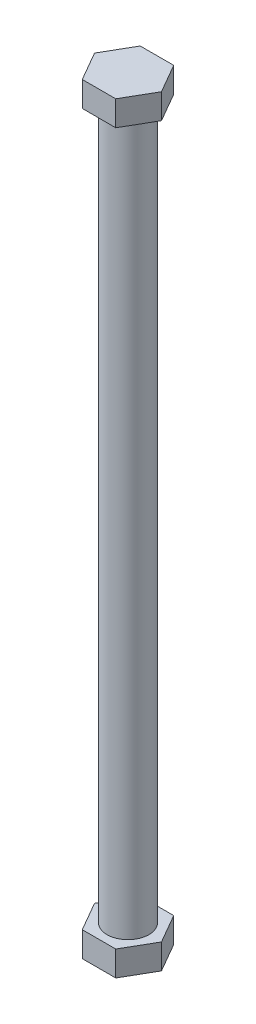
from build123d import *

# Parameters (mm, degrees)
SKETCH1_R           = 3.175
BOSS_EXTRUDE1_DEPTH = 107.95
BOSS_EXTRUDE2_DEPTH = 3.81
BOSS_EXTRUDE3_DEPTH = 3.81


with BuildPart() as part:
    # Sketch1 → Boss-Extrude1 (new body)
    with BuildSketch(Plane(origin=(0, 0, 0), x_dir=(1, 0, 0), z_dir=(0, 1, 0))):
        with Locations(Location((0, 0, 0), (0, 0, 270))):
            Circle(SKETCH1_R)
    extrude(amount=-BOSS_EXTRUDE1_DEPTH)

    # Sketch2 → Boss-Extrude2 (add)
    with BuildSketch(Plane(origin=(0, 0, 0), x_dir=(1, 0, 0), z_dir=(0, 1, 0))):
        Polygon((2.54, 4.399409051), (-2.54, 4.399409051), (-5.08, 0), (-2.54, -4.399409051), (2.54, -4.399409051), (5.08, 0), align=None)
    extrude(amount=BOSS_EXTRUDE2_DEPTH)

    # Sketch4 → Boss-Extrude3 (add)
    with BuildSketch(Plane.XZ.offset(107.95)):
        Polygon((2.54, 4.399409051), (-2.54, 4.399409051), (-5.08, 0), (-2.54, -4.399409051), (2.54, -4.399409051), (5.08, 0), align=None)
    extrude(amount=BOSS_EXTRUDE3_DEPTH)


solid = part.part
